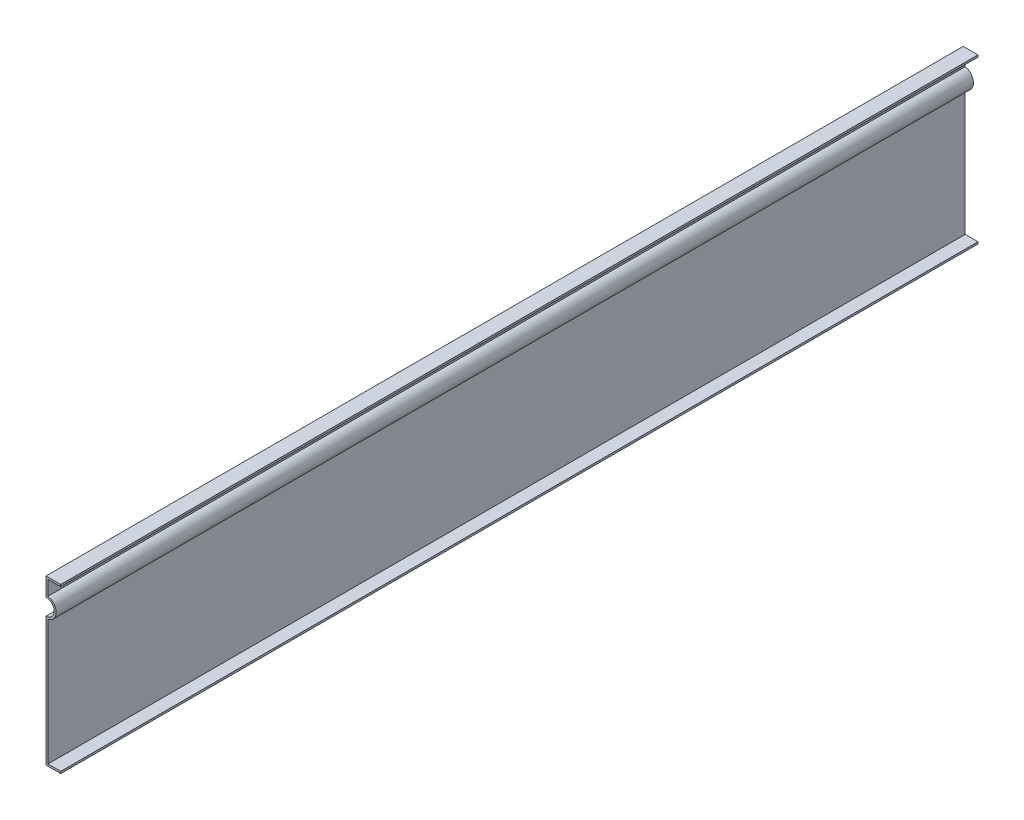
from build123d import *

# Parameters (mm, degrees)
EXTRUDE1_DEPTH = 560


with BuildPart() as part:
    # Sketch1 → Extrude1 (new body)
    with BuildSketch(Plane.XY):
        with BuildLine():
            Line((0, 0), (-7.786, 0))
            Line((-7.786, 0), (-7.786, 76.477740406))
            ThreePointArc((-7.786, 76.477740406), (-2.786, 82.572), (-7.786, 88.666259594))
            Line((-7.786, 88.666259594), (-7.786, 97.572))
            Line((-7.786, 97.572), (0, 97.572))
            Line((0, 97.572), (0, 98.786))
            Line((0, 98.786), (-9, 98.786))
            Line((-9, 98.786), (-9, 87.572))
            ThreePointArc((-9, 87.572), (-4, 82.572), (-9, 77.572))
            Line((-9, 77.572), (-9, -1.214))
            Line((-9, -1.214), (0, -1.214))
            Line((0, -1.214), (0, 0))
        make_face()
    extrude(amount=EXTRUDE1_DEPTH)


solid = part.part
